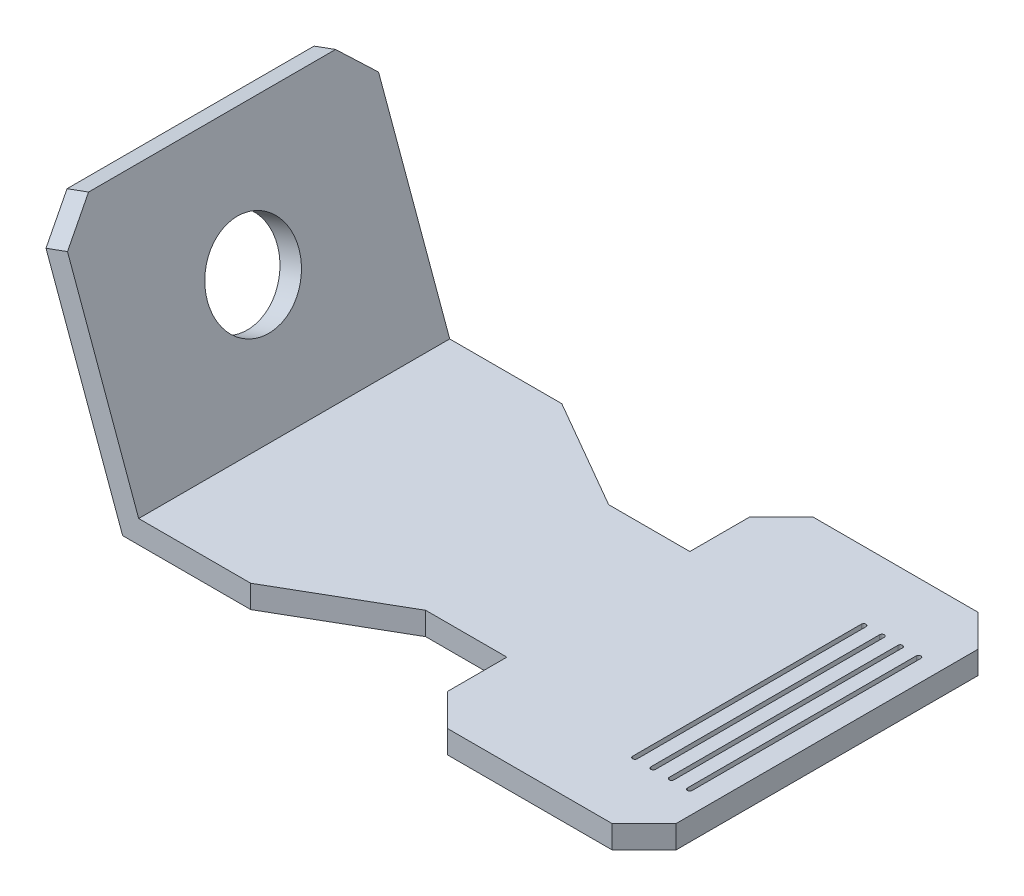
from build123d import *

# Parameters (mm, degrees)
BOSS_EXTRUDE1_DEPTH             = 5
BOSS_EXTRUDE2_REACH             = 128.59
BOSS_EXTRUDE2_DIRECTION_2_REACH = 128.59
CUT_EXTRUDE1_DEPTH              = 153.961847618
LPATTERN1_COUNT                 = 4
LPATTERN1_PITCH                 = 4
CUT_EXTRUDE2_REACH              = 144.021
SKETCH5_R                       = 10
CHAMFER1_SIZE                   = 7


with BuildPart() as part:
    # Sketch2 → Boss-Extrude1 (new body)
    with BuildSketch(Plane(origin=(0, 0, 0), x_dir=(1, 0, 0), z_dir=(0, 1, 0))):
        Polygon((0, -40), (0, 40), (-50, 40), (-50, 20), (-67.751288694, 20), (-92, 34), (-120, 34), (-120, -34), (-92, -34), (-67.751288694, -20), (-50, -20), (-50, -40), align=None)
    extrude(amount=BOSS_EXTRUDE1_DEPTH)

    # Boss-Extrude2: up to this face of the body (flat: up to its plane)
    boss_extrude2_end = Plane(part.part.faces().sort_by_distance((-106, 2.5, 34))[0])
    # Sketch3 → Boss-Extrude2 (add, up to the picked face)
    with BuildSketch(Plane.XY, mode=Mode.PRIVATE) as boss_extrude2_sk1:
        Polygon((-120, 0), (-139.153128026, 52.622786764), (-134.454664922, 54.332887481), (-115.301536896, 1.710100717), align=None)
    boss_extrude2_tool1 = split(extrude(boss_extrude2_sk1.sketch, amount=BOSS_EXTRUDE2_REACH, mode=Mode.PRIVATE), bisect_by=boss_extrude2_end, keep=Keep.BOTH, mode=Mode.PRIVATE)
    add(boss_extrude2_tool1.solids().sort_by(Axis((-127.227332, 27.166444, 0), (0, 0, 1)))[0])

    # Boss-Extrude2 direction 2: up to this face of the body (flat: up to its plane)
    boss_extrude2_direction_2_end = Plane(part.part.faces().sort_by_distance((-106, 2.5, -34))[0])
    # Sketch3 → Boss-Extrude2 direction 2 (add, up to the picked face)
    with BuildSketch(Plane.XY, mode=Mode.PRIVATE) as boss_extrude2_direction_2_sk1:
        Polygon((-120, 0), (-139.153128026, 52.622786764), (-134.454664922, 54.332887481), (-115.301536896, 1.710100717), align=None)
    boss_extrude2_direction_2_tool1 = split(extrude(boss_extrude2_direction_2_sk1.sketch, amount=-BOSS_EXTRUDE2_DIRECTION_2_REACH, mode=Mode.PRIVATE), bisect_by=boss_extrude2_direction_2_end, keep=Keep.BOTH, mode=Mode.PRIVATE)
    add(boss_extrude2_direction_2_tool1.solids().sort_by(Axis((-127.227332, 27.166444, 0), (0, 0, -1)))[0])

    # Sketch4 → Cut-Extrude1 (cut, through all)
    with BuildSketch(Plane(origin=(0, 5, 0), x_dir=(1, 0, 0), z_dir=(0, 1, 0))):
        with BuildLine():
            Line((-5.5, -25), (-5.5, 25))
            ThreePointArc((-5.5, 25), (-5, 25.5), (-4.5, 25))
            Line((-4.5, 25), (-4.5, -25))
            ThreePointArc((-4.5, -25), (-5, -25.5), (-5.5, -25))
        make_face()
    cut_extrude1 = extrude(amount=-CUT_EXTRUDE1_DEPTH, mode=Mode.SUBTRACT)

    # LPattern1: Cut-Extrude1 ×4
    with Locations(*[(-i * LPATTERN1_PITCH, 0, 0) for i in range(1, LPATTERN1_COUNT)]):
        add(cut_extrude1, mode=Mode.SUBTRACT)

    # Sketch5 → Cut-Extrude2 (cut, up to next)
    with BuildSketch(Plane(origin=(-101.264203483, -36.857155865, 0), x_dir=(0, 0, -1), z_dir=(0.9396926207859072, 0.3420201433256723, 0)), mode=Mode.PRIVATE) as cut_extrude2_sk1:
        with Locations(Location((0, 70.792936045, 0), (0, 0, 90))):
            Circle(SKETCH5_R)
    cut_extrude2_tool1 = extrude(cut_extrude2_sk1.sketch, amount=-CUT_EXTRUDE2_REACH, mode=Mode.PRIVATE) & part.part
    add(cut_extrude2_tool1.solids().sort_by_distance((-125.476814, 29.666444, 0))[0], mode=Mode.SUBTRACT)

    # Chamfer1
    chamfer1_edges = [part.edges().sort_by_distance(p)[0] for p in [
        (-50, 2.5, 40),
        (-50, 2.5, -40),
        (0, 2.5, -40),
        (0, 2.5, 40),
        (-136.803896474, 53.477837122, -34),
        (-136.803896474, 53.477837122, 34),
    ]]
    chamfer(chamfer1_edges, length=CHAMFER1_SIZE)


solid = part.part
